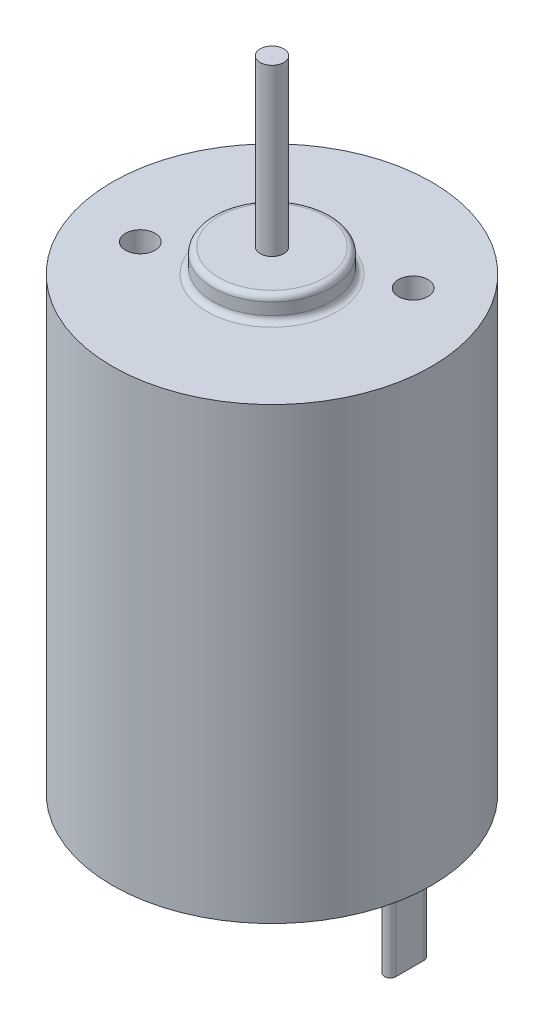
from build123d import *

# Parameters (mm, degrees)
EXTRUDE_1_DEPTH        = 7
FILLET_1_R             = 0.5
FILLET_2_R             = 0.5
HOLE_WIZARD_M3_2_D     = 2.5
HOLE_WIZARD_M3_2_DEPTH = 3
HOLE_WIZARD_M3_2_TIP   = 0.751075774


with BuildPart() as part:
    # Sketch 1 → Revolve 1 (revolve)
    with BuildSketch(Plane.XY, mode=Mode.PRIVATE) as revolve_1_sk:
        Polygon((0, 0), (1, 0), (1, 6), (5, 6), (5, 8), (13.5, 8), (13.5, 46), (5, 46), (5, 48), (1, 48), (1, 62), (0, 62), align=None)
    revolve(revolve_1_sk.sketch.rotate(Axis((0, 62, 0), (0, -1, 0)), 180), axis=Axis((0, 62, 0), (0, -1, 0)))

    # Sketch 2 → Extrude 1 (add)
    with BuildSketch(Plane.XZ.offset(-8)):
        with BuildLine():
            Line((11.668627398, 1.185458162), (11.668627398, -1.185458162))
            ThreePointArc((11.668627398, -1.185458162), (11.180497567, -1.673587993), (10.692367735, -1.185458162))
            Line((10.692367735, -1.185458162), (10.692367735, 1.185458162))
            ThreePointArc((10.692367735, 1.185458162), (11.180497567, 1.673587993), (11.668627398, 1.185458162))
        make_face()
        with BuildLine():
            Line((-11.668627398, 1.185458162), (-11.668627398, -1.185458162))
            ThreePointArc((-11.668627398, -1.185458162), (-11.180497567, -1.673587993), (-10.692367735, -1.185458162))
            Line((-10.692367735, -1.185458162), (-10.692367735, 1.185458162))
            ThreePointArc((-10.692367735, 1.185458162), (-11.180497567, 1.673587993), (-11.668627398, 1.185458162))
        make_face()
    extrude(amount=EXTRUDE_1_DEPTH)

    # Fillet 1
    fillet_1_edges = [part.edges().sort_by_distance(p)[0] for p in [
        (5, 48, 0),
        (5, 46, 0),
    ]]
    fillet(fillet_1_edges, radius=FILLET_1_R)

    # Fillet 2
    fillet_2_edges = [part.edges().sort_by_distance(p)[0] for p in [
        (5, 8, 0),
        (5, 6, 0),
    ]]
    fillet(fillet_2_edges, radius=FILLET_2_R)

    # Hole Wizard M3 _2
    with Locations(Plane(origin=(0, 46, 0), x_dir=(1, 0, 0), z_dir=(0, 1, 0))):
        with Locations((6.981890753, 4.95007086), (-7.940080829, -3.194544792)):
            Hole(HOLE_WIZARD_M3_2_D / 2, depth=HOLE_WIZARD_M3_2_DEPTH)
            with Locations((0, 0, -(HOLE_WIZARD_M3_2_DEPTH + HOLE_WIZARD_M3_2_TIP / 2))):  # 118° drill point
                Cone(0, HOLE_WIZARD_M3_2_D / 2, HOLE_WIZARD_M3_2_TIP, mode=Mode.SUBTRACT)


solid = part.part
